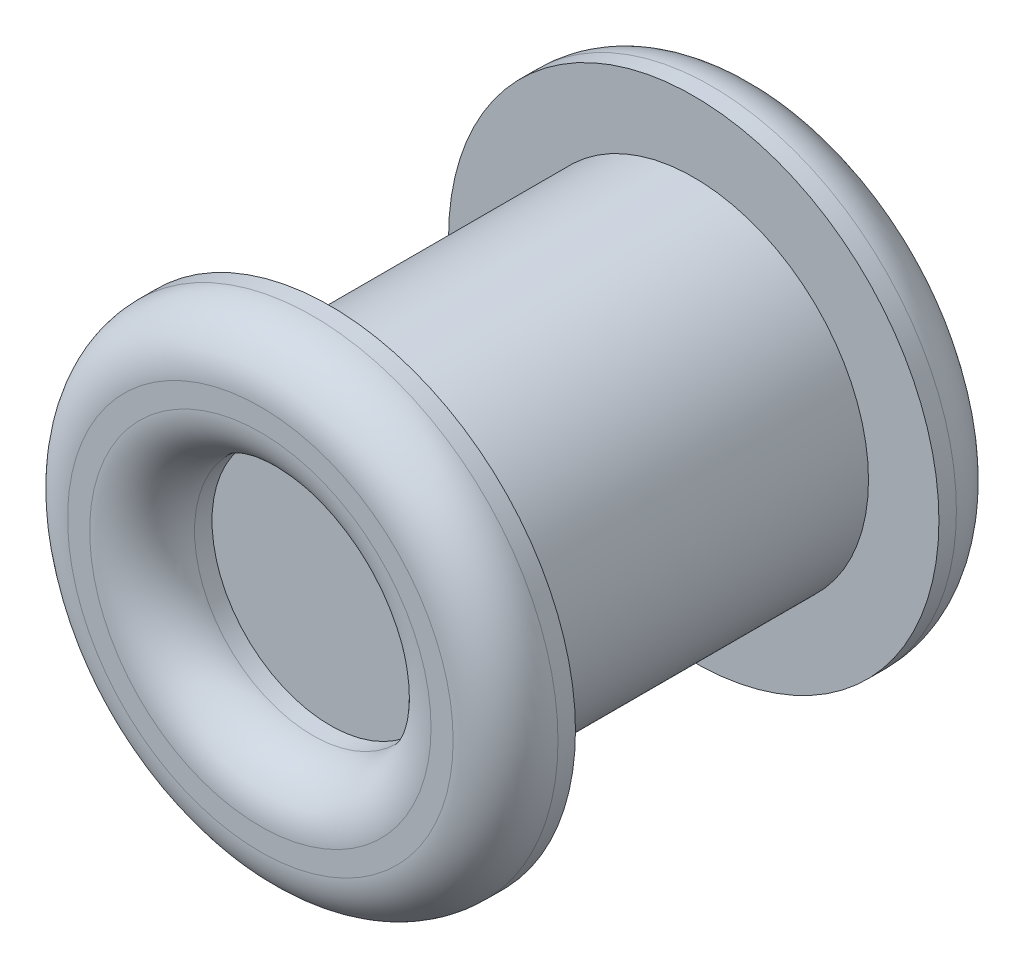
ISO-10303-21;
HEADER;
FILE_DESCRIPTION(('STEP AP214'),'2;1');
FILE_NAME('part.step','',(''),(''),'','','');
FILE_SCHEMA(('AUTOMOTIVE_DESIGN { 1 0 10303 214 1 1 1 1 }'));
ENDSEC;
DATA;
#1=APPLICATION_CONTEXT('core data for automotive mechanical design processes');
#2=APPLICATION_PROTOCOL_DEFINITION('international standard','automotive_design',2000,#1);
#3=PRODUCT_CONTEXT('',#1,'mechanical');
#4=PRODUCT('Part','Part','',(#3));
#5=PRODUCT_RELATED_PRODUCT_CATEGORY('part','',(#4));
#6=PRODUCT_DEFINITION_FORMATION('','',#4);
#7=PRODUCT_DEFINITION_CONTEXT('part definition',#1,'design');
#8=PRODUCT_DEFINITION('design','',#6,#7);
#9=PRODUCT_DEFINITION_SHAPE('','',#8);
#10=(LENGTH_UNIT() NAMED_UNIT(*) SI_UNIT(.MILLI.,.METRE.));
#11=(NAMED_UNIT(*) PLANE_ANGLE_UNIT() SI_UNIT($,.RADIAN.));
#12=(NAMED_UNIT(*) SI_UNIT($,.STERADIAN.) SOLID_ANGLE_UNIT());
#13=UNCERTAINTY_MEASURE_WITH_UNIT(LENGTH_MEASURE(1.E-05),#10,'distance_accuracy_value','');
#14=(GEOMETRIC_REPRESENTATION_CONTEXT(3) GLOBAL_UNCERTAINTY_ASSIGNED_CONTEXT((#13)) GLOBAL_UNIT_ASSIGNED_CONTEXT((#10,
#11,#12)) REPRESENTATION_CONTEXT('',''));
#15=CARTESIAN_POINT('',(0.,0.,0.));
#16=DIRECTION('',(0.,0.,1.));
#17=DIRECTION('',(1.,0.,0.));
#18=AXIS2_PLACEMENT_3D('',#15,#16,#17);
#19=CARTESIAN_POINT('',(-8.80380626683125E-13,-54.,-2.59999999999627));
#20=DIRECTION('',(0.,0.,1.));
#21=DIRECTION('',(1.,0.,0.));
#22=AXIS2_PLACEMENT_3D('',#19,#20,#21);
#23=CYLINDRICAL_SURFACE('',#22,2.5);
#24=CARTESIAN_POINT('',(-8.80380626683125E-13,-54.,-2.59999999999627));
#25=DIRECTION('',(0.,0.,-1.));
#26=DIRECTION('',(-1.,0.,0.));
#27=AXIS2_PLACEMENT_3D('',#24,#25,#26);
#28=CIRCLE('',#27,2.5);
#29=CARTESIAN_POINT('',(-2.50000000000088,-54.,-2.59999999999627));
#30=VERTEX_POINT('',#29);
#31=EDGE_CURVE('E74',#30,#30,#28,.F.);
#32=ORIENTED_EDGE('',*,*,#31,.T.);
#33=EDGE_LOOP('',(#32));
#34=FACE_BOUND('',#33,.T.);
#35=CARTESIAN_POINT('',(-8.80380626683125E-13,-54.,2.59999999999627));
#36=DIRECTION('',(0.,0.,1.));
#37=DIRECTION('',(1.,0.,0.));
#38=AXIS2_PLACEMENT_3D('',#35,#36,#37);
#39=CIRCLE('',#38,2.5);
#40=CARTESIAN_POINT('',(2.49999999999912,-54.,2.59999999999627));
#41=VERTEX_POINT('',#40);
#42=EDGE_CURVE('E68',#41,#41,#39,.T.);
#43=ORIENTED_EDGE('',*,*,#42,.F.);
#44=EDGE_LOOP('',(#43));
#45=FACE_BOUND('',#44,.T.);
#46=ADVANCED_FACE('F30',(#34,#45),#23,.T.);
#47=CARTESIAN_POINT('',(-8.80380626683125E-13,-54.,3.59999999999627));
#48=DIRECTION('',(0.,0.,1.));
#49=DIRECTION('',(1.,0.,0.));
#50=AXIS2_PLACEMENT_3D('',#47,#48,#49);
#51=PLANE('',#50);
#52=CARTESIAN_POINT('',(-8.80380626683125E-13,-54.,3.59999999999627));
#53=DIRECTION('',(0.,0.,1.));
#54=DIRECTION('',(1.,0.,0.));
#55=AXIS2_PLACEMENT_3D('',#52,#53,#54);
#56=CIRCLE('',#55,2.44177344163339);
#57=CARTESIAN_POINT('',(2.44177344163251,-54.,3.59999999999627));
#58=VERTEX_POINT('',#57);
#59=EDGE_CURVE('E41',#58,#58,#56,.F.);
#60=ORIENTED_EDGE('',*,*,#59,.T.);
#61=EDGE_LOOP('',(#60));
#62=FACE_BOUND('',#61,.T.);
#63=CARTESIAN_POINT('',(-8.80380626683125E-13,-54.,3.59999999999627));
#64=DIRECTION('',(0.,0.,1.));
#65=DIRECTION('',(1.,0.,0.));
#66=AXIS2_PLACEMENT_3D('',#63,#64,#65);
#67=CIRCLE('',#66,2.75789625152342);
#68=CARTESIAN_POINT('',(2.75789625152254,-54.,3.59999999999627));
#69=VERTEX_POINT('',#68);
#70=EDGE_CURVE('E45',#69,#69,#67,.T.);
#71=ORIENTED_EDGE('',*,*,#70,.T.);
#72=EDGE_LOOP('',(#71));
#73=FACE_BOUND('',#72,.T.);
#74=ADVANCED_FACE('F100',(#62,#73),#51,.T.);
#75=CARTESIAN_POINT('',(-8.80380626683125E-13,-54.,2.59999999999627));
#76=DIRECTION('',(0.,0.,1.));
#77=DIRECTION('',(1.,0.,0.));
#78=AXIS2_PLACEMENT_3D('',#75,#76,#77);
#79=PLANE('',#78);
#80=ORIENTED_EDGE('',*,*,#42,.T.);
#81=EDGE_LOOP('',(#80));
#82=FACE_BOUND('',#81,.T.);
#83=CARTESIAN_POINT('',(-8.80380626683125E-13,-54.,2.59999999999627));
#84=DIRECTION('',(0.,0.,1.));
#85=DIRECTION('',(1.,0.,0.));
#86=AXIS2_PLACEMENT_3D('',#83,#84,#85);
#87=CIRCLE('',#86,3.50789625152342);
#88=CARTESIAN_POINT('',(3.50789625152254,-54.,2.59999999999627));
#89=VERTEX_POINT('',#88);
#90=EDGE_CURVE('E71',#89,#89,#87,.T.);
#91=ORIENTED_EDGE('',*,*,#90,.F.);
#92=EDGE_LOOP('',(#91));
#93=FACE_BOUND('',#92,.T.);
#94=ADVANCED_FACE('F106',(#82,#93),#79,.F.);
#95=CARTESIAN_POINT('',(-8.80380626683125E-13,-54.,3.59999999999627));
#96=DIRECTION('',(0.,0.,-1.));
#97=DIRECTION('',(-1.,0.,0.));
#98=AXIS2_PLACEMENT_3D('',#95,#96,#97);
#99=CYLINDRICAL_SURFACE('',#98,3.50789625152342);
#100=CARTESIAN_POINT('',(-8.80380626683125E-13,-54.,2.84999999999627));
#101=DIRECTION('',(0.,0.,1.));
#102=DIRECTION('',(1.,0.,0.));
#103=AXIS2_PLACEMENT_3D('',#100,#101,#102);
#104=CIRCLE('',#103,3.50789625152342);
#105=CARTESIAN_POINT('',(3.50789625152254,-54.,2.84999999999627));
#106=VERTEX_POINT('',#105);
#107=EDGE_CURVE('E10',#106,#106,#104,.F.);
#108=ORIENTED_EDGE('',*,*,#107,.T.);
#109=EDGE_LOOP('',(#108));
#110=FACE_BOUND('',#109,.T.);
#111=ORIENTED_EDGE('',*,*,#90,.T.);
#112=EDGE_LOOP('',(#111));
#113=FACE_BOUND('',#112,.T.);
#114=ADVANCED_FACE('F184',(#110,#113),#99,.T.);
#115=CARTESIAN_POINT('',(-8.80380626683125E-13,-54.,3.59999999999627));
#116=DIRECTION('',(0.,0.,-1.));
#117=DIRECTION('',(-1.,0.,0.));
#118=AXIS2_PLACEMENT_3D('',#115,#116,#117);
#119=CYLINDRICAL_SURFACE('',#118,1.69177344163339);
#120=CARTESIAN_POINT('',(-8.80380626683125E-13,-54.,2.84999999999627));
#121=DIRECTION('',(0.,0.,1.));
#122=DIRECTION('',(1.,0.,0.));
#123=AXIS2_PLACEMENT_3D('',#120,#121,#122);
#124=CIRCLE('',#123,1.69177344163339);
#125=CARTESIAN_POINT('',(1.69177344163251,-54.,2.84999999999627));
#126=VERTEX_POINT('',#125);
#127=EDGE_CURVE('E50',#126,#126,#124,.T.);
#128=ORIENTED_EDGE('',*,*,#127,.T.);
#129=EDGE_LOOP('',(#128));
#130=FACE_BOUND('',#129,.T.);
#131=CARTESIAN_POINT('',(-8.80380626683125E-13,-54.,2.59999999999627));
#132=DIRECTION('',(0.,0.,1.));
#133=DIRECTION('',(1.,0.,0.));
#134=AXIS2_PLACEMENT_3D('',#131,#132,#133);
#135=CIRCLE('',#134,1.69177344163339);
#136=CARTESIAN_POINT('',(1.69177344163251,-54.,2.59999999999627));
#137=VERTEX_POINT('',#136);
#138=EDGE_CURVE('E65',#137,#137,#135,.F.);
#139=ORIENTED_EDGE('',*,*,#138,.T.);
#140=EDGE_LOOP('',(#139));
#141=FACE_BOUND('',#140,.T.);
#142=ADVANCED_FACE('F94',(#130,#141),#119,.F.);
#143=CARTESIAN_POINT('',(-8.80380626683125E-13,-54.,2.59999999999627));
#144=DIRECTION('',(0.,0.,1.));
#145=DIRECTION('',(1.,0.,0.));
#146=AXIS2_PLACEMENT_3D('',#143,#144,#145);
#147=PLANE('',#146);
#148=ORIENTED_EDGE('',*,*,#138,.F.);
#149=EDGE_LOOP('',(#148));
#150=FACE_BOUND('',#149,.T.);
#151=ADVANCED_FACE('F86',(#150),#147,.T.);
#152=CARTESIAN_POINT('',(-8.80380626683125E-13,-54.,-3.59999999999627));
#153=DIRECTION('',(0.,0.,1.));
#154=DIRECTION('',(1.,0.,0.));
#155=AXIS2_PLACEMENT_3D('',#152,#153,#154);
#156=CYLINDRICAL_SURFACE('',#155,3.50789625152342);
#157=CARTESIAN_POINT('',(-8.80380626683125E-13,-54.,-2.84999999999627));
#158=DIRECTION('',(0.,0.,-1.));
#159=DIRECTION('',(-1.,0.,0.));
#160=AXIS2_PLACEMENT_3D('',#157,#158,#159);
#161=CIRCLE('',#160,3.50789625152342);
#162=CARTESIAN_POINT('',(-3.5078962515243,-54.,-2.84999999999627));
#163=VERTEX_POINT('',#162);
#164=EDGE_CURVE('E37',#163,#163,#161,.F.);
#165=ORIENTED_EDGE('',*,*,#164,.T.);
#166=EDGE_LOOP('',(#165));
#167=FACE_BOUND('',#166,.T.);
#168=CARTESIAN_POINT('',(-8.80380626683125E-13,-54.,-2.59999999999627));
#169=DIRECTION('',(0.,0.,1.));
#170=DIRECTION('',(1.,0.,0.));
#171=AXIS2_PLACEMENT_3D('',#168,#169,#170);
#172=CIRCLE('',#171,3.50789625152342);
#173=CARTESIAN_POINT('',(3.50789625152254,-54.,-2.59999999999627));
#174=VERTEX_POINT('',#173);
#175=EDGE_CURVE('E77',#174,#174,#172,.T.);
#176=ORIENTED_EDGE('',*,*,#175,.F.);
#177=EDGE_LOOP('',(#176));
#178=FACE_BOUND('',#177,.T.);
#179=ADVANCED_FACE('F83',(#167,#178),#156,.T.);
#180=CARTESIAN_POINT('',(-8.80380626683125E-13,-54.,-3.59999999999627));
#181=DIRECTION('',(0.,0.,-1.));
#182=DIRECTION('',(1.,0.,0.));
#183=AXIS2_PLACEMENT_3D('',#180,#181,#182);
#184=PLANE('',#183);
#185=CARTESIAN_POINT('',(-8.80380626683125E-13,-54.,-3.59999999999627));
#186=DIRECTION('',(0.,0.,-1.));
#187=DIRECTION('',(-1.,0.,0.));
#188=AXIS2_PLACEMENT_3D('',#185,#186,#187);
#189=CIRCLE('',#188,2.44177344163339);
#190=CARTESIAN_POINT('',(-2.44177344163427,-54.,-3.59999999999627));
#191=VERTEX_POINT('',#190);
#192=EDGE_CURVE('E56',#191,#191,#189,.F.);
#193=ORIENTED_EDGE('',*,*,#192,.T.);
#194=EDGE_LOOP('',(#193));
#195=FACE_BOUND('',#194,.T.);
#196=CARTESIAN_POINT('',(-8.80380626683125E-13,-54.,-3.59999999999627));
#197=DIRECTION('',(0.,0.,-1.));
#198=DIRECTION('',(-1.,0.,0.));
#199=AXIS2_PLACEMENT_3D('',#196,#197,#198);
#200=CIRCLE('',#199,2.75789625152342);
#201=CARTESIAN_POINT('',(-2.7578962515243,-54.,-3.59999999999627));
#202=VERTEX_POINT('',#201);
#203=EDGE_CURVE('E59',#202,#202,#200,.T.);
#204=ORIENTED_EDGE('',*,*,#203,.T.);
#205=EDGE_LOOP('',(#204));
#206=FACE_BOUND('',#205,.T.);
#207=ADVANCED_FACE('F85',(#195,#206),#184,.T.);
#208=CARTESIAN_POINT('',(-8.80380626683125E-13,-54.,-2.59999999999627));
#209=DIRECTION('',(0.,0.,-1.));
#210=DIRECTION('',(1.,0.,0.));
#211=AXIS2_PLACEMENT_3D('',#208,#209,#210);
#212=PLANE('',#211);
#213=ORIENTED_EDGE('',*,*,#31,.F.);
#214=EDGE_LOOP('',(#213));
#215=FACE_BOUND('',#214,.T.);
#216=ORIENTED_EDGE('',*,*,#175,.T.);
#217=EDGE_LOOP('',(#216));
#218=FACE_BOUND('',#217,.T.);
#219=ADVANCED_FACE('F81',(#215,#218),#212,.F.);
#220=CARTESIAN_POINT('',(-8.80380626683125E-13,-54.,-3.59999999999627));
#221=DIRECTION('',(0.,0.,1.));
#222=DIRECTION('',(1.,0.,0.));
#223=AXIS2_PLACEMENT_3D('',#220,#221,#222);
#224=CYLINDRICAL_SURFACE('',#223,1.69177344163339);
#225=CARTESIAN_POINT('',(-8.80380626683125E-13,-54.,-2.84999999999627));
#226=DIRECTION('',(0.,0.,-1.));
#227=DIRECTION('',(-1.,0.,0.));
#228=AXIS2_PLACEMENT_3D('',#225,#226,#227);
#229=CIRCLE('',#228,1.69177344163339);
#230=CARTESIAN_POINT('',(-1.69177344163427,-54.,-2.84999999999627));
#231=VERTEX_POINT('',#230);
#232=EDGE_CURVE('E53',#231,#231,#229,.T.);
#233=ORIENTED_EDGE('',*,*,#232,.T.);
#234=EDGE_LOOP('',(#233));
#235=FACE_BOUND('',#234,.T.);
#236=CARTESIAN_POINT('',(-8.80380626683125E-13,-54.,-2.59999999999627));
#237=DIRECTION('',(0.,0.,1.));
#238=DIRECTION('',(1.,0.,0.));
#239=AXIS2_PLACEMENT_3D('',#236,#237,#238);
#240=CIRCLE('',#239,1.69177344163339);
#241=CARTESIAN_POINT('',(1.69177344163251,-54.,-2.59999999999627));
#242=VERTEX_POINT('',#241);
#243=EDGE_CURVE('E62',#242,#242,#240,.T.);
#244=ORIENTED_EDGE('',*,*,#243,.T.);
#245=EDGE_LOOP('',(#244));
#246=FACE_BOUND('',#245,.T.);
#247=ADVANCED_FACE('F158',(#235,#246),#224,.F.);
#248=CARTESIAN_POINT('',(-8.80380626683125E-13,-54.,-2.59999999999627));
#249=DIRECTION('',(0.,0.,1.));
#250=DIRECTION('',(1.,0.,0.));
#251=AXIS2_PLACEMENT_3D('',#248,#249,#250);
#252=PLANE('',#251);
#253=ORIENTED_EDGE('',*,*,#243,.F.);
#254=EDGE_LOOP('',(#253));
#255=FACE_BOUND('',#254,.T.);
#256=ADVANCED_FACE('F112',(#255),#252,.F.);
#257=CARTESIAN_POINT('',(-8.80380626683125E-13,-54.,-2.84999999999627));
#258=DIRECTION('',(0.,0.,-1.));
#259=DIRECTION('',(-1.,0.,0.));
#260=AXIS2_PLACEMENT_3D('',#257,#258,#259);
#261=TOROIDAL_SURFACE('',#260,2.44177344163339,0.75);
#262=ORIENTED_EDGE('',*,*,#232,.F.);
#263=EDGE_LOOP('',(#262));
#264=FACE_BOUND('',#263,.T.);
#265=ORIENTED_EDGE('',*,*,#192,.F.);
#266=EDGE_LOOP('',(#265));
#267=FACE_BOUND('',#266,.T.);
#268=ADVANCED_FACE('F113',(#264,#267),#261,.T.);
#269=CARTESIAN_POINT('',(-8.80380626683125E-13,-54.,2.84999999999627));
#270=DIRECTION('',(0.,0.,1.));
#271=DIRECTION('',(1.,0.,0.));
#272=AXIS2_PLACEMENT_3D('',#269,#270,#271);
#273=TOROIDAL_SURFACE('',#272,2.44177344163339,0.75);
#274=ORIENTED_EDGE('',*,*,#59,.F.);
#275=EDGE_LOOP('',(#274));
#276=FACE_BOUND('',#275,.T.);
#277=ORIENTED_EDGE('',*,*,#127,.F.);
#278=EDGE_LOOP('',(#277));
#279=FACE_BOUND('',#278,.T.);
#280=ADVANCED_FACE('F116',(#276,#279),#273,.T.);
#281=CARTESIAN_POINT('',(-8.80380626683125E-13,-54.,-2.84999999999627));
#282=DIRECTION('',(0.,0.,-1.));
#283=DIRECTION('',(-1.,0.,0.));
#284=AXIS2_PLACEMENT_3D('',#281,#282,#283);
#285=TOROIDAL_SURFACE('',#284,2.75789625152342,0.75);
#286=ORIENTED_EDGE('',*,*,#203,.F.);
#287=EDGE_LOOP('',(#286));
#288=FACE_BOUND('',#287,.T.);
#289=ORIENTED_EDGE('',*,*,#164,.F.);
#290=EDGE_LOOP('',(#289));
#291=FACE_BOUND('',#290,.T.);
#292=ADVANCED_FACE('F119',(#288,#291),#285,.T.);
#293=CARTESIAN_POINT('',(-8.80380626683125E-13,-54.,2.84999999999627));
#294=DIRECTION('',(0.,0.,1.));
#295=DIRECTION('',(1.,0.,0.));
#296=AXIS2_PLACEMENT_3D('',#293,#294,#295);
#297=TOROIDAL_SURFACE('',#296,2.75789625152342,0.75);
#298=ORIENTED_EDGE('',*,*,#107,.F.);
#299=EDGE_LOOP('',(#298));
#300=FACE_BOUND('',#299,.T.);
#301=ORIENTED_EDGE('',*,*,#70,.F.);
#302=EDGE_LOOP('',(#301));
#303=FACE_BOUND('',#302,.T.);
#304=ADVANCED_FACE('F32',(#300,#303),#297,.T.);
#305=CLOSED_SHELL('',(#46,#74,#94,#114,#142,#151,#179,#207,#219,#247,#256,#268,#280,#292,#304));
#306=MANIFOLD_SOLID_BREP('B2',#305);
#307=ADVANCED_BREP_SHAPE_REPRESENTATION('',(#18,#306),#14);
#308=SHAPE_DEFINITION_REPRESENTATION(#9,#307);
ENDSEC;
END-ISO-10303-21;
